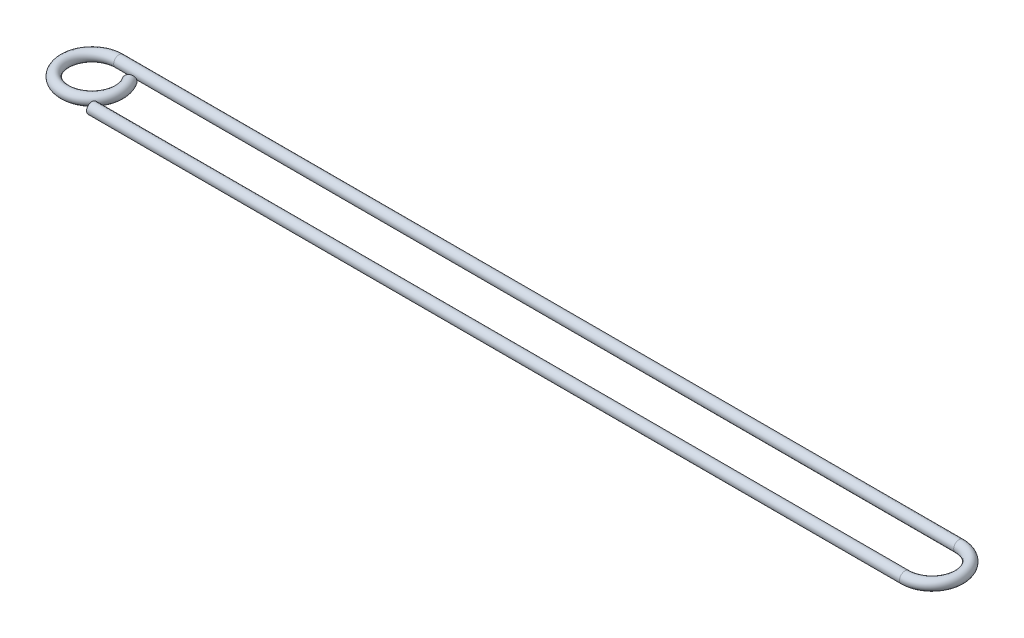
ISO-10303-21;
HEADER;
FILE_DESCRIPTION(('STEP AP214'),'2;1');
FILE_NAME('part.step','',(''),(''),'','','');
FILE_SCHEMA(('AUTOMOTIVE_DESIGN { 1 0 10303 214 1 1 1 1 }'));
ENDSEC;
DATA;
#1=APPLICATION_CONTEXT('core data for automotive mechanical design processes');
#2=APPLICATION_PROTOCOL_DEFINITION('international standard','automotive_design',2000,#1);
#3=PRODUCT_CONTEXT('',#1,'mechanical');
#4=PRODUCT('Part','Part','',(#3));
#5=PRODUCT_RELATED_PRODUCT_CATEGORY('part','',(#4));
#6=PRODUCT_DEFINITION_FORMATION('','',#4);
#7=PRODUCT_DEFINITION_CONTEXT('part definition',#1,'design');
#8=PRODUCT_DEFINITION('design','',#6,#7);
#9=PRODUCT_DEFINITION_SHAPE('','',#8);
#10=(LENGTH_UNIT() NAMED_UNIT(*) SI_UNIT(.MILLI.,.METRE.));
#11=(NAMED_UNIT(*) PLANE_ANGLE_UNIT() SI_UNIT($,.RADIAN.));
#12=(NAMED_UNIT(*) SI_UNIT($,.STERADIAN.) SOLID_ANGLE_UNIT());
#13=UNCERTAINTY_MEASURE_WITH_UNIT(LENGTH_MEASURE(1.E-05),#10,'distance_accuracy_value','');
#14=(GEOMETRIC_REPRESENTATION_CONTEXT(3) GLOBAL_UNCERTAINTY_ASSIGNED_CONTEXT((#13)) GLOBAL_UNIT_ASSIGNED_CONTEXT((#10,
#11,#12)) REPRESENTATION_CONTEXT('',''));
#15=CARTESIAN_POINT('',(0.,0.,0.));
#16=DIRECTION('',(0.,0.,1.));
#17=DIRECTION('',(1.,0.,0.));
#18=AXIS2_PLACEMENT_3D('',#15,#16,#17);
#19=CARTESIAN_POINT('',(-0.844694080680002,0.,-7.78090501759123));
#20=DIRECTION('',(-0.55618100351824,0.,-0.831061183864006));
#21=DIRECTION('',(-0.831061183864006,0.,0.55618100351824));
#22=AXIS2_PLACEMENT_3D('',#19,#20,#21);
#23=PLANE('',#22);
#24=CARTESIAN_POINT('',(-0.0136328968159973,0.,-8.33708602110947));
#25=CARTESIAN_POINT('',(-0.0136386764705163,0.056142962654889,-8.33708215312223));
#26=CARTESIAN_POINT('',(-0.01758230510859,0.112359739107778,-8.33444291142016));
#27=CARTESIAN_POINT('',(-0.0293240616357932,0.195453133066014,-8.32658483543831));
#28=CARTESIAN_POINT('',(-0.0342191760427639,0.222980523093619,-8.32330881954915));
#29=CARTESIAN_POINT('',(-0.0459222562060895,0.277468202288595,-8.31547662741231));
#30=CARTESIAN_POINT('',(-0.0527318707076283,0.30442798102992,-8.3109193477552));
#31=CARTESIAN_POINT('',(-0.0759415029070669,0.384033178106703,-8.29538648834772));
#32=CARTESIAN_POINT('',(-0.0951414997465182,0.435539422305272,-8.2825370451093));
#33=CARTESIAN_POINT('',(-0.14044657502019,0.53391675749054,-8.25221698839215));
#34=CARTESIAN_POINT('',(-0.166551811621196,0.580787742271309,-8.23474626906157));
#35=CARTESIAN_POINT('',(-0.224932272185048,0.668595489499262,-8.19567561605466));
#36=CARTESIAN_POINT('',(-0.257207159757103,0.709532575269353,-8.17407590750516));
#37=CARTESIAN_POINT('',(-0.327012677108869,0.784307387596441,-8.12735912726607));
#38=CARTESIAN_POINT('',(-0.364543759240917,0.818144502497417,-8.10224175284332));
#39=CARTESIAN_POINT('',(-0.443793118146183,0.877755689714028,-8.04920475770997));
#40=CARTESIAN_POINT('',(-0.485511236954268,0.903530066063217,-8.02128524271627));
#41=CARTESIAN_POINT('',(-0.571950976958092,0.94628494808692,-7.96343614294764));
#42=CARTESIAN_POINT('',(-0.616672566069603,0.963265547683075,-7.93350657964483));
#43=CARTESIAN_POINT('',(-0.707850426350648,0.987951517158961,-7.87248653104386));
#44=CARTESIAN_POINT('',(-0.754306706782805,0.995656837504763,-7.84139603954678));
#45=CARTESIAN_POINT('',(-0.84763496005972,1.0015732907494,-7.77893685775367));
#46=CARTESIAN_POINT('',(-0.894506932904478,0.999784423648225,-7.74756816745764));
#47=CARTESIAN_POINT('',(-0.987335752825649,0.986763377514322,-7.68544322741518));
#48=CARTESIAN_POINT('',(-1.03329260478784,0.975531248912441,-7.65468697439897));
#49=CARTESIAN_POINT('',(-1.12298740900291,0.943942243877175,-7.59465944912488));
#50=CARTESIAN_POINT('',(-1.16672533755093,0.923585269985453,-7.56538819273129));
#51=CARTESIAN_POINT('',(-1.25074154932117,0.874324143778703,-7.50916101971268));
#52=CARTESIAN_POINT('',(-1.29101970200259,0.845419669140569,-7.48220519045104));
#53=CARTESIAN_POINT('',(-1.36696852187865,0.77988481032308,-7.4313770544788));
#54=CARTESIAN_POINT('',(-1.40263958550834,0.743255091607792,-7.40750448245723));
#55=CARTESIAN_POINT('',(-1.46836470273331,0.66331489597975,-7.36351847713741));
#56=CARTESIAN_POINT('',(-1.49841845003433,0.6200040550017,-7.34340524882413));
#57=CARTESIAN_POINT('',(-1.55206355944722,0.527899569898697,-7.30750369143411));
#58=CARTESIAN_POINT('',(-1.57565506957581,0.479106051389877,-7.29171526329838));
#59=CARTESIAN_POINT('',(-1.60568777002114,0.40287609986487,-7.27161612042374));
#60=CARTESIAN_POINT('',(-1.61481396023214,0.376926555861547,-7.26550849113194));
#61=CARTESIAN_POINT('',(-1.63121041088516,0.324220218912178,-7.25453529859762));
#62=CARTESIAN_POINT('',(-1.63848226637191,0.297464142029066,-7.24966866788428));
#63=CARTESIAN_POINT('',(-1.65741518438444,0.21631533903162,-7.2369979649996));
#64=CARTESIAN_POINT('',(-1.66624613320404,0.160908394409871,-7.23108792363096));
#65=CARTESIAN_POINT('',(-1.67422331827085,0.0701715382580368,-7.22574925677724));
#66=CARTESIAN_POINT('',(-1.67575887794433,0.0351001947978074,-7.22472159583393));
#67=CARTESIAN_POINT('',(-1.67574948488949,-0.0561429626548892,-7.22472788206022));
#68=CARTESIAN_POINT('',(-1.67180585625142,-0.112359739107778,-7.22736712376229));
#69=CARTESIAN_POINT('',(-1.66006409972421,-0.195453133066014,-7.23522519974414));
#70=CARTESIAN_POINT('',(-1.65516898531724,-0.222980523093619,-7.23850121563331));
#71=CARTESIAN_POINT('',(-1.64346590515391,-0.277468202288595,-7.24633340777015));
#72=CARTESIAN_POINT('',(-1.63665629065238,-0.30442798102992,-7.25089068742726));
#73=CARTESIAN_POINT('',(-1.61344665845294,-0.384033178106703,-7.26642354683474));
#74=CARTESIAN_POINT('',(-1.59424666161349,-0.435539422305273,-7.27927299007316));
#75=CARTESIAN_POINT('',(-1.54894158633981,-0.533916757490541,-7.30959304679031));
#76=CARTESIAN_POINT('',(-1.52283634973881,-0.58078774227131,-7.32706376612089));
#77=CARTESIAN_POINT('',(-1.46445588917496,-0.668595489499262,-7.36613441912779));
#78=CARTESIAN_POINT('',(-1.4321810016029,-0.709532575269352,-7.38773412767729));
#79=CARTESIAN_POINT('',(-1.36237548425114,-0.78430738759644,-7.43445090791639));
#80=CARTESIAN_POINT('',(-1.32484440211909,-0.818144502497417,-7.45956828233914));
#81=CARTESIAN_POINT('',(-1.24559504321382,-0.877755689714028,-7.51260527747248));
#82=CARTESIAN_POINT('',(-1.20387692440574,-0.903530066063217,-7.54052479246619));
#83=CARTESIAN_POINT('',(-1.11743718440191,-0.94628494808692,-7.59837389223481));
#84=CARTESIAN_POINT('',(-1.0727155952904,-0.963265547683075,-7.62830345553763));
#85=CARTESIAN_POINT('',(-0.981537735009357,-0.987951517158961,-7.68932350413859));
#86=CARTESIAN_POINT('',(-0.935081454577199,-0.995656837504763,-7.72041399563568));
#87=CARTESIAN_POINT('',(-0.841753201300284,-1.0015732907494,-7.78287317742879));
#88=CARTESIAN_POINT('',(-0.794881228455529,-0.999784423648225,-7.81424186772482));
#89=CARTESIAN_POINT('',(-0.702052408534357,-0.986763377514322,-7.87636680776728));
#90=CARTESIAN_POINT('',(-0.656095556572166,-0.975531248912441,-7.90712306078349));
#91=CARTESIAN_POINT('',(-0.56640075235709,-0.943942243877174,-7.96715058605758));
#92=CARTESIAN_POINT('',(-0.522662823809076,-0.923585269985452,-7.99642184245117));
#93=CARTESIAN_POINT('',(-0.438646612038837,-0.874324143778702,-8.05264901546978));
#94=CARTESIAN_POINT('',(-0.398368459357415,-0.845419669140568,-8.07960484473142));
#95=CARTESIAN_POINT('',(-0.322419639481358,-0.779884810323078,-8.13043298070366));
#96=CARTESIAN_POINT('',(-0.286748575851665,-0.74325509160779,-8.15430555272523));
#97=CARTESIAN_POINT('',(-0.221023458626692,-0.663314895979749,-8.19829155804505));
#98=CARTESIAN_POINT('',(-0.190969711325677,-0.620004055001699,-8.21840478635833));
#99=CARTESIAN_POINT('',(-0.137324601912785,-0.527899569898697,-8.25430634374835));
#100=CARTESIAN_POINT('',(-0.113733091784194,-0.479106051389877,-8.27009477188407));
#101=CARTESIAN_POINT('',(-0.0837003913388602,-0.40287609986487,-8.29019391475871));
#102=CARTESIAN_POINT('',(-0.0745742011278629,-0.376926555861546,-8.29630154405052));
#103=CARTESIAN_POINT('',(-0.0581777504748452,-0.324220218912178,-8.30727473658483));
#104=CARTESIAN_POINT('',(-0.0509058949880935,-0.297464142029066,-8.31214136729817));
#105=CARTESIAN_POINT('',(-0.0319729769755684,-0.21631533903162,-8.32481207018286));
#106=CARTESIAN_POINT('',(-0.0231420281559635,-0.160908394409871,-8.3307221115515));
#107=CARTESIAN_POINT('',(-0.0151648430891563,-0.070171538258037,-8.33606077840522));
#108=CARTESIAN_POINT('',(-0.0136292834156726,-0.0351001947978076,-8.33708843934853));
#109=CARTESIAN_POINT('',(-0.0136328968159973,0.,-8.33708602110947));
#110=B_SPLINE_CURVE_WITH_KNOTS('',3,(#24,#25,#26,#27,#28,#29,#30,#31,#32,#33,#34,#35,#36,#37,
#38,#39,#40,#41,#42,#43,#44,#45,#46,#47,#48,#49,#50,#51,#52,#53,#54,#55,#56,#57,#58,#59,#60,#61,
#62,#63,#64,#65,#66,#67,#68,#69,#70,#71,#72,#73,#74,#75,#76,#77,#78,#79,#80,#81,#82,#83,#84,#85,
#86,#87,#88,#89,#90,#91,#92,#93,#94,#95,#96,#97,#98,#99,#100,#101,#102,#103,#104,#105,#106,#107,
#108,#109),.UNSPECIFIED.,.T.,.F.,(4,2,2,2,2,2,2,2,2,2,2,2,2,2,2,2,2,2,2,2,2,2,2,2,2,2,2,2,2,2,2,
2,2,2,2,2,2,2,2,2,2,2,4),(0.,0.168304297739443,0.252675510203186,0.337119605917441,
0.50560227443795,0.674088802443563,0.842566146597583,1.01105799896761,1.17954349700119,
1.34802719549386,1.516511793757,1.68499639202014,1.85348009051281,2.02196558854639,
2.19045744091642,2.35893478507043,2.52742131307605,2.69590398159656,2.78034807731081,
2.86471928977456,3.033023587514,3.138246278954,3.30655057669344,3.39092178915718,
3.47536588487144,3.64384855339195,3.81233508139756,3.98081242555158,4.14930427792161,
4.31778977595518,4.48627347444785,4.654758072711,4.82324267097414,4.99172636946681,
5.16021186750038,5.32870371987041,5.49718106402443,5.66566759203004,5.83415026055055,
5.91859435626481,6.00296556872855,6.17126986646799,6.27649255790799),.UNSPECIFIED.);
#111=CARTESIAN_POINT('',(-0.0136328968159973,0.,-8.33708602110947));
#112=VERTEX_POINT('',#111);
#113=EDGE_CURVE('E40',#112,#112,#110,.T.);
#114=ORIENTED_EDGE('',*,*,#113,.F.);
#115=EDGE_LOOP('',(#114));
#116=FACE_BOUND('',#115,.T.);
#117=ADVANCED_FACE('F36',(#116),#23,.T.);
#118=CARTESIAN_POINT('',(150.,0.,-5.));
#119=DIRECTION('',(0.,1.,0.));
#120=DIRECTION('',(0.,0.,1.));
#121=AXIS2_PLACEMENT_3D('',#118,#119,#120);
#122=TOROIDAL_SURFACE('',#121,5.,1.);
#123=CARTESIAN_POINT('',(150.,0.,-10.));
#124=DIRECTION('',(-1.,0.,0.));
#125=DIRECTION('',(0.,0.,1.));
#126=AXIS2_PLACEMENT_3D('',#123,#124,#125);
#127=CIRCLE('',#126,0.999999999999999);
#128=CARTESIAN_POINT('',(150.,0.,-9.));
#129=VERTEX_POINT('',#128);
#130=EDGE_CURVE('E50',#129,#129,#127,.T.);
#131=ORIENTED_EDGE('',*,*,#130,.F.);
#132=EDGE_LOOP('',(#131));
#133=FACE_BOUND('',#132,.T.);
#134=CARTESIAN_POINT('',(150.,0.,0.));
#135=DIRECTION('',(1.,0.,0.));
#136=DIRECTION('',(0.,0.,1.));
#137=AXIS2_PLACEMENT_3D('',#134,#135,#136);
#138=CIRCLE('',#137,1.);
#139=CARTESIAN_POINT('',(150.,0.,1.));
#140=VERTEX_POINT('',#139);
#141=EDGE_CURVE('E58',#140,#140,#138,.T.);
#142=ORIENTED_EDGE('',*,*,#141,.T.);
#143=EDGE_LOOP('',(#142));
#144=FACE_BOUND('',#143,.T.);
#145=ADVANCED_FACE('F71',(#133,#144),#122,.T.);
#146=CARTESIAN_POINT('',(-5.,0.,-4.99999999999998));
#147=DIRECTION('',(0.,1.,0.));
#148=DIRECTION('',(0.,0.,1.));
#149=AXIS2_PLACEMENT_3D('',#146,#147,#148);
#150=TOROIDAL_SURFACE('',#149,5.,1.);
#151=ORIENTED_EDGE('',*,*,#113,.T.);
#152=EDGE_LOOP('',(#151));
#153=FACE_BOUND('',#152,.T.);
#154=CARTESIAN_POINT('',(-5.00000000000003,0.,-9.99999999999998));
#155=DIRECTION('',(-1.,0.,0.));
#156=DIRECTION('',(0.,0.,1.));
#157=AXIS2_PLACEMENT_3D('',#154,#155,#156);
#158=CIRCLE('',#157,0.999999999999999);
#159=CARTESIAN_POINT('',(-5.00000000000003,0.,-8.99999999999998));
#160=VERTEX_POINT('',#159);
#161=EDGE_CURVE('E11',#160,#160,#158,.F.);
#162=ORIENTED_EDGE('',*,*,#161,.F.);
#163=EDGE_LOOP('',(#162));
#164=FACE_BOUND('',#163,.T.);
#165=ADVANCED_FACE('F73',(#153,#164),#150,.T.);
#166=CARTESIAN_POINT('',(150.,0.,-10.));
#167=DIRECTION('',(-1.,0.,0.));
#168=DIRECTION('',(0.,0.,1.));
#169=AXIS2_PLACEMENT_3D('',#166,#167,#168);
#170=CYLINDRICAL_SURFACE('',#169,0.999999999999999);
#171=ORIENTED_EDGE('',*,*,#161,.T.);
#172=EDGE_LOOP('',(#171));
#173=FACE_BOUND('',#172,.T.);
#174=ORIENTED_EDGE('',*,*,#130,.T.);
#175=EDGE_LOOP('',(#174));
#176=FACE_BOUND('',#175,.T.);
#177=ADVANCED_FACE('F78',(#173,#176),#170,.T.);
#178=CARTESIAN_POINT('',(0.,0.,0.));
#179=DIRECTION('',(1.,0.,0.));
#180=DIRECTION('',(0.,0.,-1.));
#181=AXIS2_PLACEMENT_3D('',#178,#179,#180);
#182=CYLINDRICAL_SURFACE('',#181,1.);
#183=CARTESIAN_POINT('',(0.,0.,0.));
#184=DIRECTION('',(-1.,0.,0.));
#185=DIRECTION('',(0.,0.,1.));
#186=AXIS2_PLACEMENT_3D('',#183,#184,#185);
#187=CIRCLE('',#186,1.);
#188=CARTESIAN_POINT('',(0.,0.,1.));
#189=VERTEX_POINT('',#188);
#190=EDGE_CURVE('E61',#189,#189,#187,.T.);
#191=ORIENTED_EDGE('',*,*,#190,.F.);
#192=EDGE_LOOP('',(#191));
#193=FACE_BOUND('',#192,.T.);
#194=ORIENTED_EDGE('',*,*,#141,.F.);
#195=EDGE_LOOP('',(#194));
#196=FACE_BOUND('',#195,.T.);
#197=ADVANCED_FACE('F82',(#193,#196),#182,.T.);
#198=CARTESIAN_POINT('',(0.,0.,0.));
#199=DIRECTION('',(-1.,0.,0.));
#200=DIRECTION('',(0.,0.,1.));
#201=AXIS2_PLACEMENT_3D('',#198,#199,#200);
#202=PLANE('',#201);
#203=ORIENTED_EDGE('',*,*,#190,.T.);
#204=EDGE_LOOP('',(#203));
#205=FACE_BOUND('',#204,.T.);
#206=ADVANCED_FACE('F85',(#205),#202,.T.);
#207=CLOSED_SHELL('',(#117,#145,#165,#177,#197,#206));
#208=MANIFOLD_SOLID_BREP('B2',#207);
#209=ADVANCED_BREP_SHAPE_REPRESENTATION('',(#18,#208),#14);
#210=SHAPE_DEFINITION_REPRESENTATION(#9,#209);
ENDSEC;
END-ISO-10303-21;
